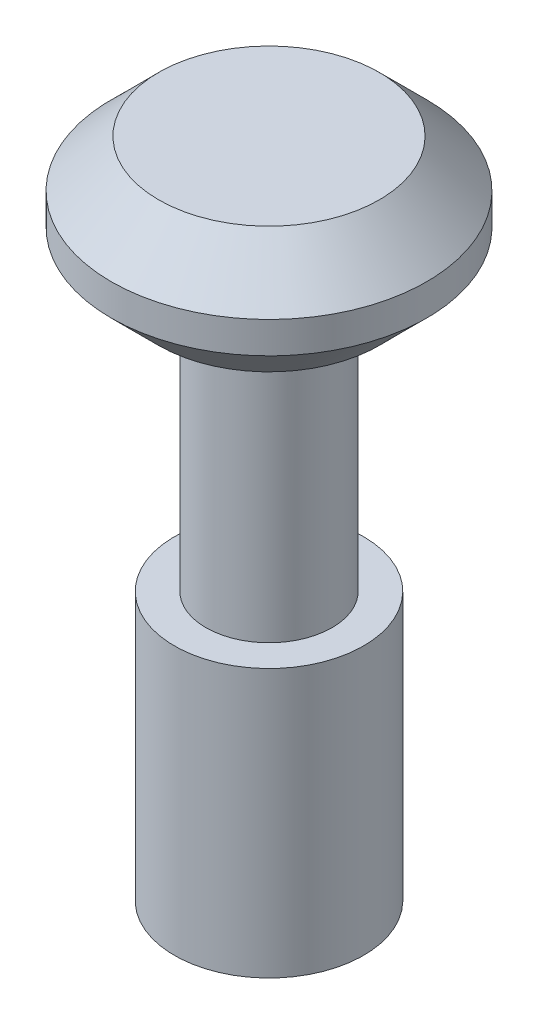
ISO-10303-21;
HEADER;
FILE_DESCRIPTION(('STEP AP214'),'2;1');
FILE_NAME('part.step','',(''),(''),'','','');
FILE_SCHEMA(('AUTOMOTIVE_DESIGN { 1 0 10303 214 1 1 1 1 }'));
ENDSEC;
DATA;
#1=APPLICATION_CONTEXT('core data for automotive mechanical design processes');
#2=APPLICATION_PROTOCOL_DEFINITION('international standard','automotive_design',2000,#1);
#3=PRODUCT_CONTEXT('',#1,'mechanical');
#4=PRODUCT('Part','Part','',(#3));
#5=PRODUCT_RELATED_PRODUCT_CATEGORY('part','',(#4));
#6=PRODUCT_DEFINITION_FORMATION('','',#4);
#7=PRODUCT_DEFINITION_CONTEXT('part definition',#1,'design');
#8=PRODUCT_DEFINITION('design','',#6,#7);
#9=PRODUCT_DEFINITION_SHAPE('','',#8);
#10=(LENGTH_UNIT() NAMED_UNIT(*) SI_UNIT(.MILLI.,.METRE.));
#11=(NAMED_UNIT(*) PLANE_ANGLE_UNIT() SI_UNIT($,.RADIAN.));
#12=(NAMED_UNIT(*) SI_UNIT($,.STERADIAN.) SOLID_ANGLE_UNIT());
#13=UNCERTAINTY_MEASURE_WITH_UNIT(LENGTH_MEASURE(1.E-05),#10,'distance_accuracy_value','');
#14=(GEOMETRIC_REPRESENTATION_CONTEXT(3) GLOBAL_UNCERTAINTY_ASSIGNED_CONTEXT((#13)) GLOBAL_UNIT_ASSIGNED_CONTEXT((#10,
#11,#12)) REPRESENTATION_CONTEXT('',''));
#15=CARTESIAN_POINT('',(0.,0.,0.));
#16=DIRECTION('',(0.,0.,1.));
#17=DIRECTION('',(1.,0.,0.));
#18=AXIS2_PLACEMENT_3D('',#15,#16,#17);
#19=CARTESIAN_POINT('',(0.,0.,0.));
#20=DIRECTION('',(0.,1.,0.));
#21=DIRECTION('',(0.,0.,1.));
#22=AXIS2_PLACEMENT_3D('',#19,#20,#21);
#23=PLANE('',#22);
#24=CARTESIAN_POINT('',(0.,0.,0.));
#25=DIRECTION('',(0.,1.,0.));
#26=DIRECTION('',(0.,0.,1.));
#27=AXIS2_PLACEMENT_3D('',#24,#25,#26);
#28=CIRCLE('',#27,3.5);
#29=CARTESIAN_POINT('',(0.,0.,3.5));
#30=VERTEX_POINT('',#29);
#31=EDGE_CURVE('E76',#30,#30,#28,.F.);
#32=ORIENTED_EDGE('',*,*,#31,.T.);
#33=EDGE_LOOP('',(#32));
#34=FACE_BOUND('',#33,.T.);
#35=CARTESIAN_POINT('',(0.,0.,0.));
#36=DIRECTION('',(0.,1.,0.));
#37=DIRECTION('',(0.,0.,1.));
#38=AXIS2_PLACEMENT_3D('',#35,#36,#37);
#39=CIRCLE('',#38,2.);
#40=CARTESIAN_POINT('',(0.,0.,2.));
#41=VERTEX_POINT('',#40);
#42=EDGE_CURVE('E11',#41,#41,#39,.F.);
#43=ORIENTED_EDGE('',*,*,#42,.F.);
#44=EDGE_LOOP('',(#43));
#45=FACE_BOUND('',#44,.T.);
#46=ADVANCED_FACE('F36',(#34,#45),#23,.F.);
#47=CARTESIAN_POINT('',(0.,4.,0.));
#48=DIRECTION('',(0.,-1.,0.));
#49=DIRECTION('',(0.,0.,-1.));
#50=AXIS2_PLACEMENT_3D('',#47,#48,#49);
#51=CYLINDRICAL_SURFACE('',#50,5.);
#52=CARTESIAN_POINT('',(0.,1.5,0.));
#53=DIRECTION('',(0.,1.,0.));
#54=DIRECTION('',(0.,0.,1.));
#55=AXIS2_PLACEMENT_3D('',#52,#53,#54);
#56=CIRCLE('',#55,5.);
#57=CARTESIAN_POINT('',(0.,1.5,5.));
#58=VERTEX_POINT('',#57);
#59=EDGE_CURVE('E73',#58,#58,#56,.T.);
#60=ORIENTED_EDGE('',*,*,#59,.T.);
#61=EDGE_LOOP('',(#60));
#62=FACE_BOUND('',#61,.T.);
#63=CARTESIAN_POINT('',(0.,2.5,0.));
#64=DIRECTION('',(0.,1.,0.));
#65=DIRECTION('',(0.,0.,1.));
#66=AXIS2_PLACEMENT_3D('',#63,#64,#65);
#67=CIRCLE('',#66,5.);
#68=CARTESIAN_POINT('',(0.,2.5,5.));
#69=VERTEX_POINT('',#68);
#70=EDGE_CURVE('E70',#69,#69,#67,.F.);
#71=ORIENTED_EDGE('',*,*,#70,.T.);
#72=EDGE_LOOP('',(#71));
#73=FACE_BOUND('',#72,.T.);
#74=ADVANCED_FACE('F97',(#62,#73),#51,.T.);
#75=CARTESIAN_POINT('',(0.,4.,0.));
#76=DIRECTION('',(0.,1.,0.));
#77=DIRECTION('',(0.,0.,1.));
#78=AXIS2_PLACEMENT_3D('',#75,#76,#77);
#79=PLANE('',#78);
#80=CARTESIAN_POINT('',(0.,4.,0.));
#81=DIRECTION('',(0.,1.,0.));
#82=DIRECTION('',(0.,0.,1.));
#83=AXIS2_PLACEMENT_3D('',#80,#81,#82);
#84=CIRCLE('',#83,3.5);
#85=CARTESIAN_POINT('',(0.,4.,3.5));
#86=VERTEX_POINT('',#85);
#87=EDGE_CURVE('E43',#86,#86,#84,.T.);
#88=ORIENTED_EDGE('',*,*,#87,.T.);
#89=EDGE_LOOP('',(#88));
#90=FACE_BOUND('',#89,.T.);
#91=ADVANCED_FACE('F81',(#90),#79,.T.);
#92=CARTESIAN_POINT('',(0.,1.5,0.));
#93=DIRECTION('',(0.,1.,0.));
#94=DIRECTION('',(0.,0.,1.));
#95=AXIS2_PLACEMENT_3D('',#92,#93,#94);
#96=CONICAL_SURFACE('',#95,5.,0.78539816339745);
#97=ORIENTED_EDGE('',*,*,#31,.F.);
#98=EDGE_LOOP('',(#97));
#99=FACE_BOUND('',#98,.T.);
#100=ORIENTED_EDGE('',*,*,#59,.F.);
#101=EDGE_LOOP('',(#100));
#102=FACE_BOUND('',#101,.T.);
#103=ADVANCED_FACE('F85',(#99,#102),#96,.T.);
#104=CARTESIAN_POINT('',(0.,4.,0.));
#105=DIRECTION('',(0.,-1.,0.));
#106=DIRECTION('',(0.,0.,-1.));
#107=AXIS2_PLACEMENT_3D('',#104,#105,#106);
#108=CONICAL_SURFACE('',#107,3.5,0.785398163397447);
#109=ORIENTED_EDGE('',*,*,#70,.F.);
#110=EDGE_LOOP('',(#109));
#111=FACE_BOUND('',#110,.T.);
#112=ORIENTED_EDGE('',*,*,#87,.F.);
#113=EDGE_LOOP('',(#112));
#114=FACE_BOUND('',#113,.T.);
#115=ADVANCED_FACE('F38',(#111,#114),#108,.T.);
#116=CARTESIAN_POINT('',(0.,-8.5,0.));
#117=DIRECTION('',(0.,1.,0.));
#118=DIRECTION('',(0.,0.,1.));
#119=AXIS2_PLACEMENT_3D('',#116,#117,#118);
#120=CYLINDRICAL_SURFACE('',#119,2.);
#121=CARTESIAN_POINT('',(0.,-8.5,0.));
#122=DIRECTION('',(0.,-1.,0.));
#123=DIRECTION('',(0.,0.,-1.));
#124=AXIS2_PLACEMENT_3D('',#121,#122,#123);
#125=CIRCLE('',#124,2.);
#126=CARTESIAN_POINT('',(0.,-8.5,-2.));
#127=VERTEX_POINT('',#126);
#128=EDGE_CURVE('E66',#127,#127,#125,.T.);
#129=ORIENTED_EDGE('',*,*,#128,.F.);
#130=EDGE_LOOP('',(#129));
#131=FACE_BOUND('',#130,.T.);
#132=ORIENTED_EDGE('',*,*,#42,.T.);
#133=EDGE_LOOP('',(#132));
#134=FACE_BOUND('',#133,.T.);
#135=ADVANCED_FACE('F84',(#131,#134),#120,.T.);
#136=CARTESIAN_POINT('',(0.,-8.5,0.));
#137=DIRECTION('',(0.,-1.,0.));
#138=DIRECTION('',(0.,0.,-1.));
#139=AXIS2_PLACEMENT_3D('',#136,#137,#138);
#140=PLANE('',#139);
#141=CARTESIAN_POINT('',(0.,-8.5,0.));
#142=DIRECTION('',(0.,-1.,0.));
#143=DIRECTION('',(0.,0.,-1.));
#144=AXIS2_PLACEMENT_3D('',#141,#142,#143);
#145=CIRCLE('',#144,3.);
#146=CARTESIAN_POINT('',(0.,-8.5,-3.));
#147=VERTEX_POINT('',#146);
#148=EDGE_CURVE('E56',#147,#147,#145,.T.);
#149=ORIENTED_EDGE('',*,*,#148,.F.);
#150=EDGE_LOOP('',(#149));
#151=FACE_BOUND('',#150,.T.);
#152=ORIENTED_EDGE('',*,*,#128,.T.);
#153=EDGE_LOOP('',(#152));
#154=FACE_BOUND('',#153,.T.);
#155=ADVANCED_FACE('F91',(#151,#154),#140,.F.);
#156=CARTESIAN_POINT('',(0.,-17.,0.));
#157=DIRECTION('',(0.,1.,0.));
#158=DIRECTION('',(0.,0.,1.));
#159=AXIS2_PLACEMENT_3D('',#156,#157,#158);
#160=CYLINDRICAL_SURFACE('',#159,3.);
#161=CARTESIAN_POINT('',(0.,-17.,0.));
#162=DIRECTION('',(0.,-1.,0.));
#163=DIRECTION('',(0.,0.,-1.));
#164=AXIS2_PLACEMENT_3D('',#161,#162,#163);
#165=CIRCLE('',#164,3.);
#166=CARTESIAN_POINT('',(0.,-17.,-3.));
#167=VERTEX_POINT('',#166);
#168=EDGE_CURVE('E60',#167,#167,#165,.T.);
#169=ORIENTED_EDGE('',*,*,#168,.F.);
#170=EDGE_LOOP('',(#169));
#171=FACE_BOUND('',#170,.T.);
#172=ORIENTED_EDGE('',*,*,#148,.T.);
#173=EDGE_LOOP('',(#172));
#174=FACE_BOUND('',#173,.T.);
#175=ADVANCED_FACE('F109',(#171,#174),#160,.T.);
#176=CARTESIAN_POINT('',(0.,-17.,0.));
#177=DIRECTION('',(0.,-1.,0.));
#178=DIRECTION('',(0.,0.,-1.));
#179=AXIS2_PLACEMENT_3D('',#176,#177,#178);
#180=PLANE('',#179);
#181=CARTESIAN_POINT('',(0.,-17.,0.));
#182=DIRECTION('',(0.,-1.,0.));
#183=DIRECTION('',(0.,0.,-1.));
#184=AXIS2_PLACEMENT_3D('',#181,#182,#183);
#185=CIRCLE('',#184,1.25);
#186=CARTESIAN_POINT('',(0.,-17.,-1.25));
#187=VERTEX_POINT('',#186);
#188=EDGE_CURVE('E57',#187,#187,#185,.T.);
#189=ORIENTED_EDGE('',*,*,#188,.F.);
#190=EDGE_LOOP('',(#189));
#191=FACE_BOUND('',#190,.T.);
#192=ORIENTED_EDGE('',*,*,#168,.T.);
#193=EDGE_LOOP('',(#192));
#194=FACE_BOUND('',#193,.T.);
#195=ADVANCED_FACE('F50',(#191,#194),#180,.T.);
#196=CARTESIAN_POINT('',(0.,-12.,0.));
#197=DIRECTION('',(0.,-1.,0.));
#198=DIRECTION('',(0.,0.,-1.));
#199=AXIS2_PLACEMENT_3D('',#196,#197,#198);
#200=CONICAL_SURFACE('',#199,1.25,1.02974425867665);
#201=CARTESIAN_POINT('',(0.,-11.2489242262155,0.));
#202=VERTEX_POINT('',#201);
#203=VERTEX_LOOP('',#202);
#204=FACE_BOUND('',#203,.T.);
#205=CARTESIAN_POINT('',(0.,-12.,0.));
#206=DIRECTION('',(0.,-1.,0.));
#207=DIRECTION('',(0.,0.,-1.));
#208=AXIS2_PLACEMENT_3D('',#205,#206,#207);
#209=CIRCLE('',#208,1.25);
#210=CARTESIAN_POINT('',(0.,-12.,-1.25));
#211=VERTEX_POINT('',#210);
#212=EDGE_CURVE('E54',#211,#211,#209,.T.);
#213=ORIENTED_EDGE('',*,*,#212,.T.);
#214=EDGE_LOOP('',(#213));
#215=FACE_BOUND('',#214,.T.);
#216=ADVANCED_FACE('F46',(#204,#215),#200,.F.);
#217=CARTESIAN_POINT('',(0.,-17.,0.));
#218=DIRECTION('',(0.,-1.,0.));
#219=DIRECTION('',(0.,0.,-1.));
#220=AXIS2_PLACEMENT_3D('',#217,#218,#219);
#221=CYLINDRICAL_SURFACE('',#220,1.25);
#222=ORIENTED_EDGE('',*,*,#212,.F.);
#223=EDGE_LOOP('',(#222));
#224=FACE_BOUND('',#223,.T.);
#225=ORIENTED_EDGE('',*,*,#188,.T.);
#226=EDGE_LOOP('',(#225));
#227=FACE_BOUND('',#226,.T.);
#228=ADVANCED_FACE('F49',(#224,#227),#221,.F.);
#229=CLOSED_SHELL('',(#46,#74,#91,#103,#115,#135,#155,#175,#195,#216,#228));
#230=MANIFOLD_SOLID_BREP('B2',#229);
#231=ADVANCED_BREP_SHAPE_REPRESENTATION('',(#18,#230),#14);
#232=SHAPE_DEFINITION_REPRESENTATION(#9,#231);
ENDSEC;
END-ISO-10303-21;
